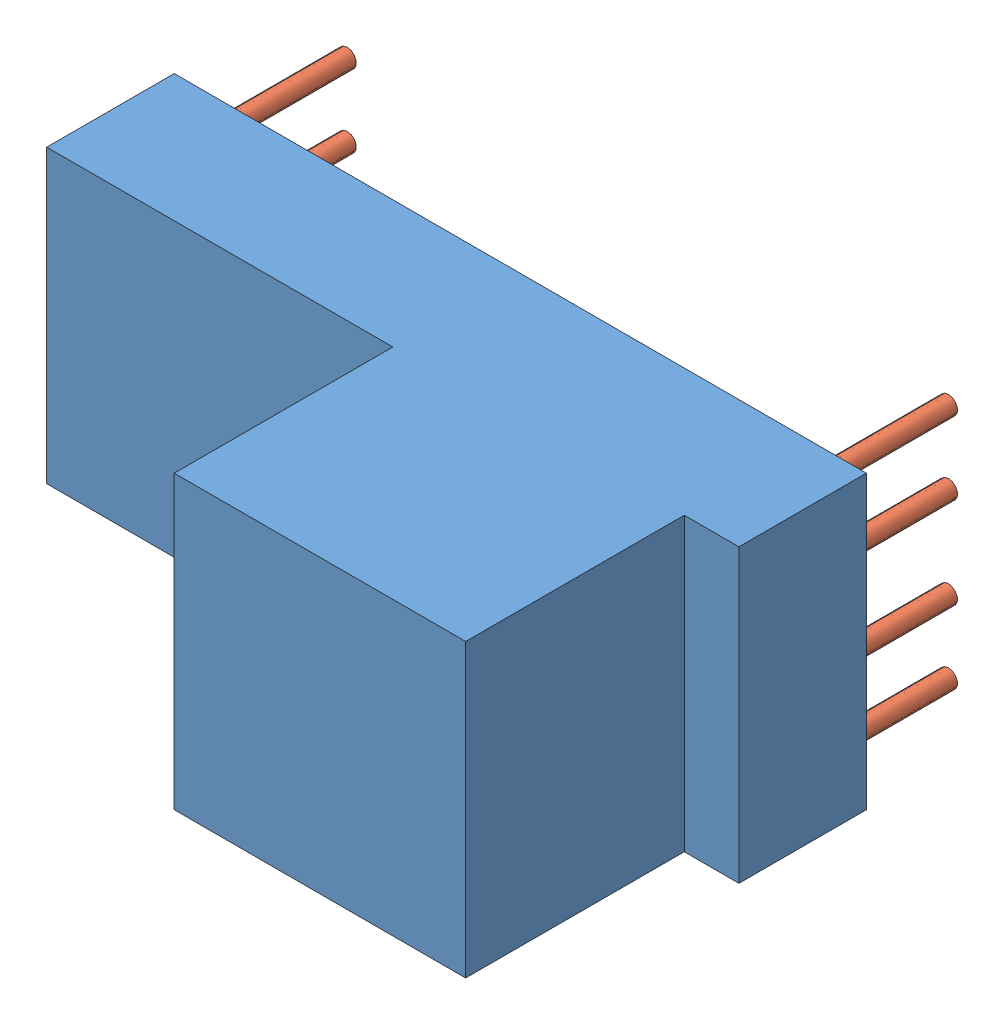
SolidWorks assembly 60D_Transfo_asemblé.SLDASM, configuration Défaut (file format 3100). Lengths in mm.
Overall size (19 8 13).
9 component instances, 2 part files, 24 mates.
Components (placement in the parent):
- 60D_Transfo-1: 60D_Transfo.SLDPRT [Défaut] at (0.4259 1.2624 -4.75) size (19 8 9.5)
- Patte_transfo-3: Patte_transfo.SLDPRT [Défaut] at (8.6759 4.5124 -8.25) x (1 0 0) z (0 -1 0) size (0.5 3.5 0.5)
- Patte_transfo-4: Patte_transfo.SLDPRT [Défaut] at (8.6759 -1.9876 -8.25) x (1 0 0) z (0 -1 0) size (0.5 3.5 0.5)
- Patte_transfo-5: Patte_transfo.SLDPRT [Défaut] at (8.6759 2.5124 -8.25) x (1 0 0) z (0 -1 0) size (0.5 3.5 0.5)
- Patte_transfo-6: Patte_transfo.SLDPRT [Défaut] at (8.6759 0.0124 -8.25) x (1 0 0) z (0 -1 0) size (0.5 3.5 0.5)
- Patte_transfo-7: Patte_transfo.SLDPRT [Défaut] at (-7.8241 4.5124 -8.25) x (1 0 0) z (0 -1 0) size (0.5 3.5 0.5)
- Patte_transfo-8: Patte_transfo.SLDPRT [Défaut] at (-7.8241 2.5124 -8.25) x (1 0 0) z (0 -1 0) size (0.5 3.5 0.5)
- Patte_transfo-9: Patte_transfo.SLDPRT [Défaut] at (-7.8241 0.0124 -8.25) x (1 0 0) z (0 -1 0) size (0.5 3.5 0.5)
- Patte_transfo-10: Patte_transfo.SLDPRT [Défaut] at (-7.8241 -1.9876 -8.25) x (1 0 0) z (0 -1 0) size (0.5 3.5 0.5)
Mates (geometry in assembly coordinates):
- Coïncidente4: coincident anti-aligned: plane of 60D_Transfo-1 through (-9.0741 -2.7376 -4.75) normal (0 0 -1); circle of Patte_transfo-3 centre (8.6759 4.5124 -4.75) axis (0 0 1)
- Distance9: distance = 1 mm aligned: plane of 60D_Transfo-1 through (9.9259 5.2624 -1.25) normal (1 0 0); cylinder of Patte_transfo-3
- Distance10: distance = 7 mm aligned: plane of 60D_Transfo-1 through (-9.0741 -2.7376 -1.25) normal (0 -1 0); cylinder of Patte_transfo-3
- Coïncidente5: coincident anti-aligned: plane of 60D_Transfo-1 through (-9.0741 -2.7376 -4.75) normal (0 0 -1); circle of Patte_transfo-4 centre (8.6759 -1.9876 -4.75) axis (0 0 1)
- Distance11: distance = 1 mm aligned: plane of 60D_Transfo-1 through (9.9259 5.2624 -1.25) normal (1 0 0); cylinder of Patte_transfo-4
- Distance13: distance = 7 mm aligned: plane of 60D_Transfo-1 through (-9.0741 5.2624 -1.25) normal (0 1 0); cylinder of Patte_transfo-4
- Coïncidente6: coincident anti-aligned: plane of 60D_Transfo-1 through (-9.0741 -2.7376 -4.75) normal (0 0 -1); circle of Patte_transfo-5 centre (8.6759 2.5124 -4.75) axis (0 0 1)
- Distance14: distance = 1 mm aligned: plane of 60D_Transfo-1 through (9.9259 5.2624 -1.25) normal (1 0 0); cylinder of Patte_transfo-5
- Distance16: distance = 5 mm aligned: plane of 60D_Transfo-1 through (-9.0741 -2.7376 -1.25) normal (0 -1 0); cylinder of Patte_transfo-5
- Coïncidente7: coincident anti-aligned: plane of 60D_Transfo-1; circle of Patte_transfo-6
- Distance17: distance = 1 mm aligned: plane of 60D_Transfo-1; cylinder of Patte_transfo-6
- Distance18: distance = 2.5 mm aligned: plane of 60D_Transfo-1; cylinder of Patte_transfo-6
- Coïncidente9: coincident: plane of 60D_Transfo-1; circle of Patte_transfo-7
- Distance19: distance = 1 mm: plane of 60D_Transfo-1; cylinder of Patte_transfo-7
- Distance20: distance = 0.5 mm aligned: plane of 60D_Transfo-1; cylinder of Patte_transfo-7
- Coïncidente10: coincident: plane of 60D_Transfo-1; circle of Patte_transfo-8
- Distance21: distance = 1 mm: plane of 60D_Transfo-1; cylinder of Patte_transfo-8
- Distance22: distance = 2.5 mm aligned: plane of 60D_Transfo-1; cylinder of Patte_transfo-8
- Coïncidente11: coincident: plane of 60D_Transfo-1; circle of Patte_transfo-9
- Distance23: distance = 1 mm: plane of 60D_Transfo-1; cylinder of Patte_transfo-9
- Distance24: distance = 5 mm aligned: plane of 60D_Transfo-1; cylinder of Patte_transfo-9
- Coïncidente12: coincident: plane of 60D_Transfo-1; circle of Patte_transfo-10
- Distance25: distance = 1 mm: plane of 60D_Transfo-1; cylinder of Patte_transfo-10
- Distance26: distance = 7 mm aligned: plane of 60D_Transfo-1; cylinder of Patte_transfo-10
